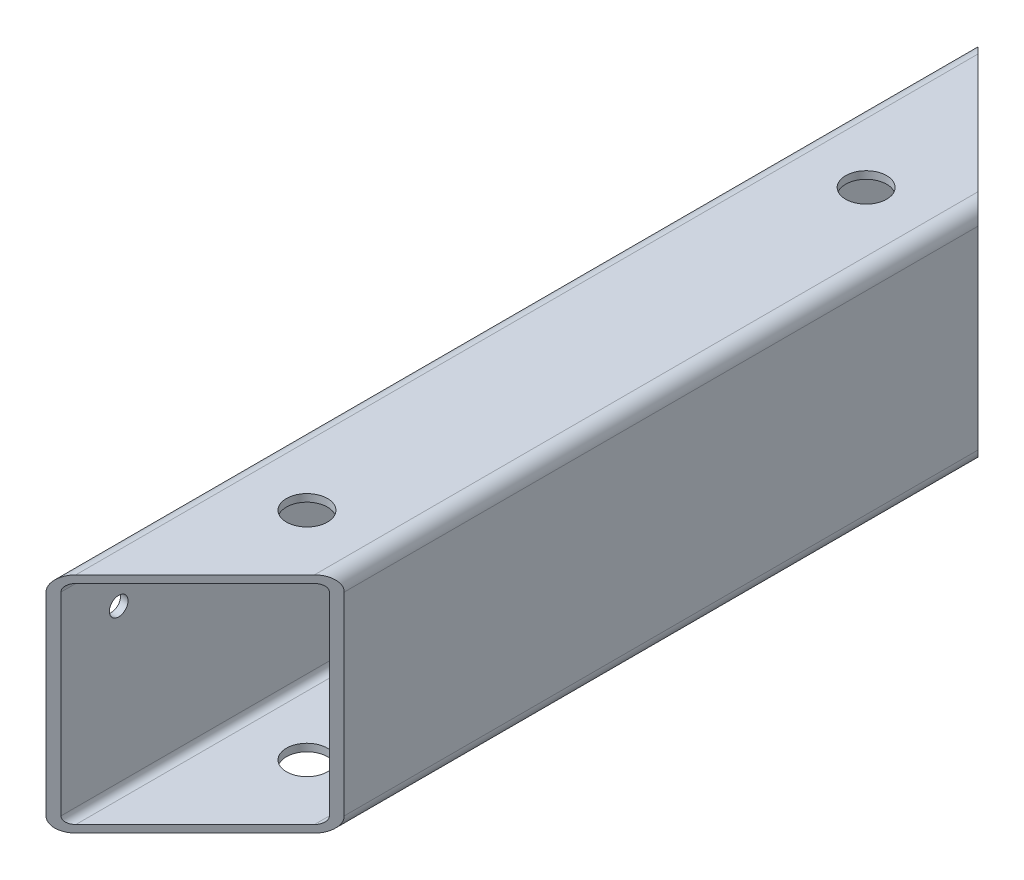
from build123d import *

# Parameters (mm, degrees)
BASE_EXTRU_MINCE_DEPTH       = 125
ENL_V_MAT_EXTRU_1_DEPTH      = 60
ENL_V_MAT_EXTRU_2_REACH      = 136.629
ESQUISSE3_R                  = 2.5
ENL_V_MAT_EXTRU_3_DEPTH      = 131.096118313
ENL_V_MAT_EXTRU_3_DEPTH_BACK = 131.096118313
ESQUISSE5_R                  = 5.5


with BuildPart() as part:
    # Esquisse1 → Base-Extru.-Mince (new, symmetric)
    with BuildSketch(Plane.XY):
        with BuildLine():
            Line((16, 30), (-16, 30))
            ThreePointArc((-16, 30), (-18.828427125, 28.828427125), (-20, 26))
            Line((-20, 26), (-20, -26))
            ThreePointArc((-20, -26), (-18.828427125, -28.828427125), (-16, -30))
            Line((-16, -30), (16, -30))
            ThreePointArc((16, -30), (18.828427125, -28.828427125), (20, -26))
            Line((20, -26), (20, 26))
            ThreePointArc((20, 26), (18.828427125, 28.828427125), (16, 30))
        make_face()
        with BuildLine():
            Line((16, 28), (-16, 28))
            ThreePointArc((-16, 28), (-17.414213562, 27.414213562), (-18, 26))
            Line((-18, 26), (-18, -26))
            ThreePointArc((-18, -26), (-17.414213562, -27.414213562), (-16, -28))
            Line((-16, -28), (16, -28))
            ThreePointArc((16, -28), (17.414213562, -27.414213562), (18, -26))
            Line((18, -26), (18, 26))
            ThreePointArc((18, 26), (17.414213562, 27.414213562), (16, 28))
        make_face(mode=Mode.SUBTRACT)
    extrude(amount=BASE_EXTRU_MINCE_DEPTH, both=True)

    # Esquisse2 → Enl_v. mat.-Extru.1 (cut)
    with BuildSketch(Plane(origin=(0, 30, 0), x_dir=(-1, 0, 0), z_dir=(0, 1, 0))):
        Polygon((20, -125), (-20, -85), (-20, -125), align=None)
        Polygon((20, 125), (-20, 85), (-20, 125), align=None)
    extrude(amount=-ENL_V_MAT_EXTRU_1_DEPTH, mode=Mode.SUBTRACT)

    # Esquisse3 → Enl_v. mat.-Extru.2 (cut, up to next)
    with BuildSketch(Plane.ZY.offset(20), mode=Mode.PRIVATE) as enl_v_mat_extru_2_sk1:
        with Locations(Location((0, -15, 0), (0, 0, 270))):
            Circle(ESQUISSE3_R)
    enl_v_mat_extru_2_tool1 = extrude(enl_v_mat_extru_2_sk1.sketch, amount=-ENL_V_MAT_EXTRU_2_REACH, mode=Mode.PRIVATE) & part.part
    # Esquisse3 → Enl_v. mat.-Extru.2 (cut, up to next)
    with BuildSketch(Plane.ZY.offset(20), mode=Mode.PRIVATE) as enl_v_mat_extru_2_sk2:
        with Locations(Location((107.5, 15, 0), (0, 0, 270))):
            Circle(ESQUISSE3_R)
    enl_v_mat_extru_2_tool2 = extrude(enl_v_mat_extru_2_sk2.sketch, amount=-ENL_V_MAT_EXTRU_2_REACH, mode=Mode.PRIVATE) & part.part
    # Esquisse3 → Enl_v. mat.-Extru.2 (cut, up to next)
    with BuildSketch(Plane.ZY.offset(20), mode=Mode.PRIVATE) as enl_v_mat_extru_2_sk3:
        with Locations(Location((-107.5, 15, 0), (0, 0, 270))):
            Circle(ESQUISSE3_R)
    enl_v_mat_extru_2_tool3 = extrude(enl_v_mat_extru_2_sk3.sketch, amount=-ENL_V_MAT_EXTRU_2_REACH, mode=Mode.PRIVATE) & part.part
    add(enl_v_mat_extru_2_tool1.solids().sort_by_distance((-20, -15, 0))[0], mode=Mode.SUBTRACT)
    add(enl_v_mat_extru_2_tool2.solids().sort_by_distance((-20, 15, 107.5))[0], mode=Mode.SUBTRACT)
    add(enl_v_mat_extru_2_tool3.solids().sort_by_distance((-20, 15, -107.5))[0], mode=Mode.SUBTRACT)

    # Esquisse5 → Enl_v. mat.-Extru.3 (cut, two sides: drawn at the far end of the back side and taken through both)
    with BuildSketch(Plane(origin=(0, 0, 0), x_dir=(1, 0, 0), z_dir=(0, 1, 0)).offset(-ENL_V_MAT_EXTRU_3_DEPTH_BACK)):
        with Locations(Location((0, -75, 0), (0, 0, 270))):
            Circle(ESQUISSE5_R)
        with Locations(Location((0, 75, 0), (0, 0, 270))):
            Circle(ESQUISSE5_R)
    extrude(amount=ENL_V_MAT_EXTRU_3_DEPTH + ENL_V_MAT_EXTRU_3_DEPTH_BACK, mode=Mode.SUBTRACT)


solid = part.part
